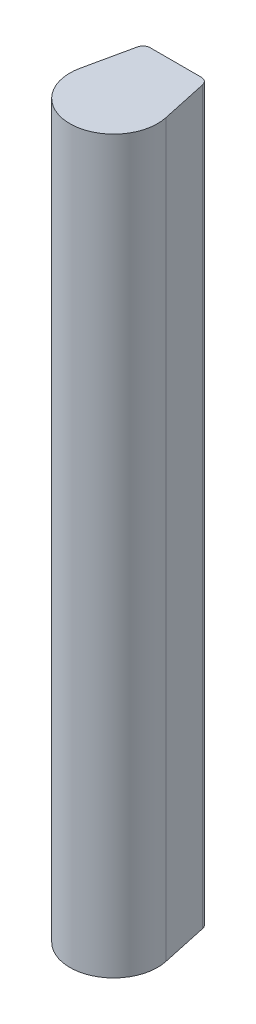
ISO-10303-21;
HEADER;
FILE_DESCRIPTION(('STEP AP214'),'2;1');
FILE_NAME('part.step','',(''),(''),'','','');
FILE_SCHEMA(('AUTOMOTIVE_DESIGN { 1 0 10303 214 1 1 1 1 }'));
ENDSEC;
DATA;
#1=APPLICATION_CONTEXT('core data for automotive mechanical design processes');
#2=APPLICATION_PROTOCOL_DEFINITION('international standard','automotive_design',2000,#1);
#3=PRODUCT_CONTEXT('',#1,'mechanical');
#4=PRODUCT('Part','Part','',(#3));
#5=PRODUCT_RELATED_PRODUCT_CATEGORY('part','',(#4));
#6=PRODUCT_DEFINITION_FORMATION('','',#4);
#7=PRODUCT_DEFINITION_CONTEXT('part definition',#1,'design');
#8=PRODUCT_DEFINITION('design','',#6,#7);
#9=PRODUCT_DEFINITION_SHAPE('','',#8);
#10=(LENGTH_UNIT() NAMED_UNIT(*) SI_UNIT(.MILLI.,.METRE.));
#11=(NAMED_UNIT(*) PLANE_ANGLE_UNIT() SI_UNIT($,.RADIAN.));
#12=(NAMED_UNIT(*) SI_UNIT($,.STERADIAN.) SOLID_ANGLE_UNIT());
#13=UNCERTAINTY_MEASURE_WITH_UNIT(LENGTH_MEASURE(1.E-05),#10,'distance_accuracy_value','');
#14=(GEOMETRIC_REPRESENTATION_CONTEXT(3) GLOBAL_UNCERTAINTY_ASSIGNED_CONTEXT((#13)) GLOBAL_UNIT_ASSIGNED_CONTEXT((#10,
#11,#12)) REPRESENTATION_CONTEXT('',''));
#15=CARTESIAN_POINT('',(0.,0.,0.));
#16=DIRECTION('',(0.,0.,1.));
#17=DIRECTION('',(1.,0.,0.));
#18=AXIS2_PLACEMENT_3D('',#15,#16,#17);
#19=CARTESIAN_POINT('',(8.872719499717,50.8,-19.05));
#20=DIRECTION('',(0.,-1.,0.));
#21=DIRECTION('',(0.,0.,-1.));
#22=AXIS2_PLACEMENT_3D('',#19,#20,#21);
#23=CYLINDRICAL_SURFACE('',#22,2.54);
#24=DIRECTION('',(0.,1.,0.));
#25=VECTOR('',#24,1.);
#26=CARTESIAN_POINT('',(11.355294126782,50.8,-19.5870504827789));
#27=LINE('',#26,#25);
#28=CARTESIAN_POINT('',(11.355294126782,254.,-19.5870504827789));
#29=VERTEX_POINT('',#28);
#30=CARTESIAN_POINT('',(11.355294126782,0.,-19.5870504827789));
#31=VERTEX_POINT('',#30);
#32=EDGE_CURVE('E68',#29,#31,#27,.F.);
#33=ORIENTED_EDGE('',*,*,#32,.T.);
#34=CARTESIAN_POINT('',(8.872719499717,0.,-19.05));
#35=DIRECTION('',(0.,-1.,0.));
#36=DIRECTION('',(0.,0.,-1.));
#37=AXIS2_PLACEMENT_3D('',#34,#35,#36);
#38=CIRCLE('',#37,2.54);
#39=CARTESIAN_POINT('',(8.872719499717,0.,-21.59));
#40=VERTEX_POINT('',#39);
#41=EDGE_CURVE('E20',#31,#40,#38,.F.);
#42=ORIENTED_EDGE('',*,*,#41,.T.);
#43=DIRECTION('',(0.,1.,0.));
#44=VECTOR('',#43,1.);
#45=CARTESIAN_POINT('',(8.872719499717,50.8,-21.59));
#46=LINE('',#45,#44);
#47=CARTESIAN_POINT('',(8.872719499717,254.,-21.59));
#48=VERTEX_POINT('',#47);
#49=EDGE_CURVE('E103',#40,#48,#46,.T.);
#50=ORIENTED_EDGE('',*,*,#49,.T.);
#51=CARTESIAN_POINT('',(8.872719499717,254.,-19.05));
#52=DIRECTION('',(0.,-1.,0.));
#53=DIRECTION('',(0.,0.,-1.));
#54=AXIS2_PLACEMENT_3D('',#51,#52,#53);
#55=CIRCLE('',#54,2.54);
#56=EDGE_CURVE('E72',#29,#48,#55,.F.);
#57=ORIENTED_EDGE('',*,*,#56,.F.);
#58=EDGE_LOOP('',(#33,#42,#50,#57));
#59=FACE_BOUND('',#58,.T.);
#60=ADVANCED_FACE('F16',(#59),#23,.T.);
#61=CARTESIAN_POINT('',(-10.922,50.8,-21.59));
#62=DIRECTION('',(0.,0.,1.));
#63=DIRECTION('',(1.,0.,0.));
#64=AXIS2_PLACEMENT_3D('',#61,#62,#63);
#65=PLANE('',#64);
#66=DIRECTION('',(0.,-1.,0.));
#67=VECTOR('',#66,1.);
#68=CARTESIAN_POINT('',(-8.87271949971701,50.8,-21.59));
#69=LINE('',#68,#67);
#70=CARTESIAN_POINT('',(-8.87271949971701,254.,-21.59));
#71=VERTEX_POINT('',#70);
#72=CARTESIAN_POINT('',(-8.87271949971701,0.,-21.59));
#73=VERTEX_POINT('',#72);
#74=EDGE_CURVE('E85',#71,#73,#69,.T.);
#75=ORIENTED_EDGE('',*,*,#74,.F.);
#76=DIRECTION('',(1.,0.,0.));
#77=VECTOR('',#76,1.);
#78=CARTESIAN_POINT('',(8.872719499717,254.,-21.59));
#79=LINE('',#78,#77);
#80=EDGE_CURVE('E91',#48,#71,#79,.F.);
#81=ORIENTED_EDGE('',*,*,#80,.F.);
#82=ORIENTED_EDGE('',*,*,#49,.F.);
#83=DIRECTION('',(1.,0.,0.));
#84=VECTOR('',#83,1.);
#85=CARTESIAN_POINT('',(0.,0.,-21.59));
#86=LINE('',#85,#84);
#87=EDGE_CURVE('E84',#40,#73,#86,.F.);
#88=ORIENTED_EDGE('',*,*,#87,.T.);
#89=EDGE_LOOP('',(#75,#81,#82,#88));
#90=FACE_BOUND('',#89,.T.);
#91=ADVANCED_FACE('F126',(#90),#65,.F.);
#92=CARTESIAN_POINT('',(-8.87271949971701,50.8,-19.05));
#93=DIRECTION('',(0.,-1.,0.));
#94=DIRECTION('',(0.,0.,-1.));
#95=AXIS2_PLACEMENT_3D('',#92,#93,#94);
#96=CYLINDRICAL_SURFACE('',#95,2.54);
#97=ORIENTED_EDGE('',*,*,#74,.T.);
#98=CARTESIAN_POINT('',(-8.87271949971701,0.,-19.05));
#99=DIRECTION('',(0.,-1.,0.));
#100=DIRECTION('',(0.,0.,-1.));
#101=AXIS2_PLACEMENT_3D('',#98,#99,#100);
#102=CIRCLE('',#101,2.54);
#103=CARTESIAN_POINT('',(-11.355294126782,0.,-19.5870504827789));
#104=VERTEX_POINT('',#103);
#105=EDGE_CURVE('E77',#73,#104,#102,.F.);
#106=ORIENTED_EDGE('',*,*,#105,.T.);
#107=DIRECTION('',(0.,1.,0.));
#108=VECTOR('',#107,1.);
#109=CARTESIAN_POINT('',(-11.355294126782,50.8,-19.5870504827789));
#110=LINE('',#109,#108);
#111=CARTESIAN_POINT('',(-11.355294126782,254.,-19.5870504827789));
#112=VERTEX_POINT('',#111);
#113=EDGE_CURVE('E98',#104,#112,#110,.T.);
#114=ORIENTED_EDGE('',*,*,#113,.T.);
#115=CARTESIAN_POINT('',(-8.87271949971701,254.,-19.05));
#116=DIRECTION('',(0.,-1.,0.));
#117=DIRECTION('',(0.,0.,-1.));
#118=AXIS2_PLACEMENT_3D('',#115,#116,#117);
#119=CIRCLE('',#118,2.54);
#120=EDGE_CURVE('E109',#71,#112,#119,.F.);
#121=ORIENTED_EDGE('',*,*,#120,.F.);
#122=EDGE_LOOP('',(#97,#106,#114,#121));
#123=FACE_BOUND('',#122,.T.);
#124=ADVANCED_FACE('F123',(#123),#96,.T.);
#125=CARTESIAN_POINT('',(0.,0.,0.));
#126=DIRECTION('',(0.,1.,0.));
#127=DIRECTION('',(0.,0.,1.));
#128=AXIS2_PLACEMENT_3D('',#125,#126,#127);
#129=PLANE('',#128);
#130=ORIENTED_EDGE('',*,*,#105,.F.);
#131=ORIENTED_EDGE('',*,*,#87,.F.);
#132=ORIENTED_EDGE('',*,*,#41,.F.);
#133=DIRECTION('',(0.21143719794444,0.,0.977391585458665));
#134=VECTOR('',#133,1.);
#135=CARTESIAN_POINT('',(14.8954477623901,0.,-3.22230289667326));
#136=LINE('',#135,#134);
#137=CARTESIAN_POINT('',(14.8954477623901,0.,-3.22230289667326));
#138=VERTEX_POINT('',#137);
#139=EDGE_CURVE('E76',#31,#138,#136,.T.);
#140=ORIENTED_EDGE('',*,*,#139,.T.);
#141=CARTESIAN_POINT('',(0.,0.,0.));
#142=DIRECTION('',(0.,-1.,0.));
#143=DIRECTION('',(0.,0.,-1.));
#144=AXIS2_PLACEMENT_3D('',#141,#142,#143);
#145=CIRCLE('',#144,15.24);
#146=CARTESIAN_POINT('',(-14.8954477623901,0.,-3.22230289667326));
#147=VERTEX_POINT('',#146);
#148=EDGE_CURVE('E107',#147,#138,#145,.F.);
#149=ORIENTED_EDGE('',*,*,#148,.F.);
#150=DIRECTION('',(0.21143719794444,0.,-0.977391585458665));
#151=VECTOR('',#150,1.);
#152=CARTESIAN_POINT('',(-14.8954477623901,0.,-3.22230289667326));
#153=LINE('',#152,#151);
#154=EDGE_CURVE('E95',#147,#104,#153,.T.);
#155=ORIENTED_EDGE('',*,*,#154,.T.);
#156=EDGE_LOOP('',(#130,#131,#132,#140,#149,#155));
#157=FACE_BOUND('',#156,.T.);
#158=ADVANCED_FACE('F82',(#157),#129,.F.);
#159=CARTESIAN_POINT('',(14.8954477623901,50.8,-3.22230289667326));
#160=DIRECTION('',(-0.977391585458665,0.,0.21143719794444));
#161=DIRECTION('',(0.21143719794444,0.,0.977391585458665));
#162=AXIS2_PLACEMENT_3D('',#159,#160,#161);
#163=PLANE('',#162);
#164=ORIENTED_EDGE('',*,*,#32,.F.);
#165=DIRECTION('',(-0.21143719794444,0.,-0.977391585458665));
#166=VECTOR('',#165,1.);
#167=CARTESIAN_POINT('',(14.8954477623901,254.,-3.22230289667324));
#168=LINE('',#167,#166);
#169=CARTESIAN_POINT('',(14.8954477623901,254.,-3.22230289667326));
#170=VERTEX_POINT('',#169);
#171=EDGE_CURVE('E99',#170,#29,#168,.T.);
#172=ORIENTED_EDGE('',*,*,#171,.F.);
#173=DIRECTION('',(0.,-1.,0.));
#174=VECTOR('',#173,1.);
#175=CARTESIAN_POINT('',(14.8954477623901,50.8,-3.22230289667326));
#176=LINE('',#175,#174);
#177=EDGE_CURVE('E88',#138,#170,#176,.F.);
#178=ORIENTED_EDGE('',*,*,#177,.F.);
#179=ORIENTED_EDGE('',*,*,#139,.F.);
#180=EDGE_LOOP('',(#164,#172,#178,#179));
#181=FACE_BOUND('',#180,.T.);
#182=ADVANCED_FACE('F86',(#181),#163,.F.);
#183=CARTESIAN_POINT('',(8.872719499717,254.,-19.05));
#184=DIRECTION('',(0.,1.,0.));
#185=DIRECTION('',(0.,0.,1.));
#186=AXIS2_PLACEMENT_3D('',#183,#184,#185);
#187=PLANE('',#186);
#188=CARTESIAN_POINT('',(0.,254.,0.));
#189=DIRECTION('',(0.,-1.,0.));
#190=DIRECTION('',(0.,0.,-1.));
#191=AXIS2_PLACEMENT_3D('',#188,#189,#190);
#192=CIRCLE('',#191,15.24);
#193=CARTESIAN_POINT('',(-14.8954477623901,254.,-3.22230289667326));
#194=VERTEX_POINT('',#193);
#195=EDGE_CURVE('E26',#170,#194,#192,.T.);
#196=ORIENTED_EDGE('',*,*,#195,.F.);
#197=ORIENTED_EDGE('',*,*,#171,.T.);
#198=ORIENTED_EDGE('',*,*,#56,.T.);
#199=ORIENTED_EDGE('',*,*,#80,.T.);
#200=ORIENTED_EDGE('',*,*,#120,.T.);
#201=DIRECTION('',(0.21143719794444,0.,-0.977391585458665));
#202=VECTOR('',#201,1.);
#203=CARTESIAN_POINT('',(-14.8954477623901,254.,-3.22230289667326));
#204=LINE('',#203,#202);
#205=EDGE_CURVE('E35',#112,#194,#204,.F.);
#206=ORIENTED_EDGE('',*,*,#205,.T.);
#207=EDGE_LOOP('',(#196,#197,#198,#199,#200,#206));
#208=FACE_BOUND('',#207,.T.);
#209=ADVANCED_FACE('F124',(#208),#187,.T.);
#210=CARTESIAN_POINT('',(-14.8954477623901,50.8,-3.22230289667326));
#211=DIRECTION('',(0.977391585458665,0.,0.21143719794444));
#212=DIRECTION('',(0.21143719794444,0.,-0.977391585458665));
#213=AXIS2_PLACEMENT_3D('',#210,#211,#212);
#214=PLANE('',#213);
#215=ORIENTED_EDGE('',*,*,#205,.F.);
#216=ORIENTED_EDGE('',*,*,#113,.F.);
#217=ORIENTED_EDGE('',*,*,#154,.F.);
#218=DIRECTION('',(0.,-1.,0.));
#219=VECTOR('',#218,1.);
#220=CARTESIAN_POINT('',(-14.8954477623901,50.8,-3.22230289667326));
#221=LINE('',#220,#219);
#222=EDGE_CURVE('E11',#194,#147,#221,.T.);
#223=ORIENTED_EDGE('',*,*,#222,.F.);
#224=EDGE_LOOP('',(#215,#216,#217,#223));
#225=FACE_BOUND('',#224,.T.);
#226=ADVANCED_FACE('F121',(#225),#214,.F.);
#227=CARTESIAN_POINT('',(0.,50.8,0.));
#228=DIRECTION('',(0.,-1.,0.));
#229=DIRECTION('',(0.,0.,-1.));
#230=AXIS2_PLACEMENT_3D('',#227,#228,#229);
#231=CYLINDRICAL_SURFACE('',#230,15.24);
#232=ORIENTED_EDGE('',*,*,#195,.T.);
#233=ORIENTED_EDGE('',*,*,#222,.T.);
#234=ORIENTED_EDGE('',*,*,#148,.T.);
#235=ORIENTED_EDGE('',*,*,#177,.T.);
#236=EDGE_LOOP('',(#232,#233,#234,#235));
#237=FACE_BOUND('',#236,.T.);
#238=ADVANCED_FACE('F18',(#237),#231,.T.);
#239=CLOSED_SHELL('',(#60,#91,#124,#158,#182,#209,#226,#238));
#240=MANIFOLD_SOLID_BREP('B1',#239);
#241=ADVANCED_BREP_SHAPE_REPRESENTATION('',(#18,#240),#14);
#242=SHAPE_DEFINITION_REPRESENTATION(#9,#241);
ENDSEC;
END-ISO-10303-21;
